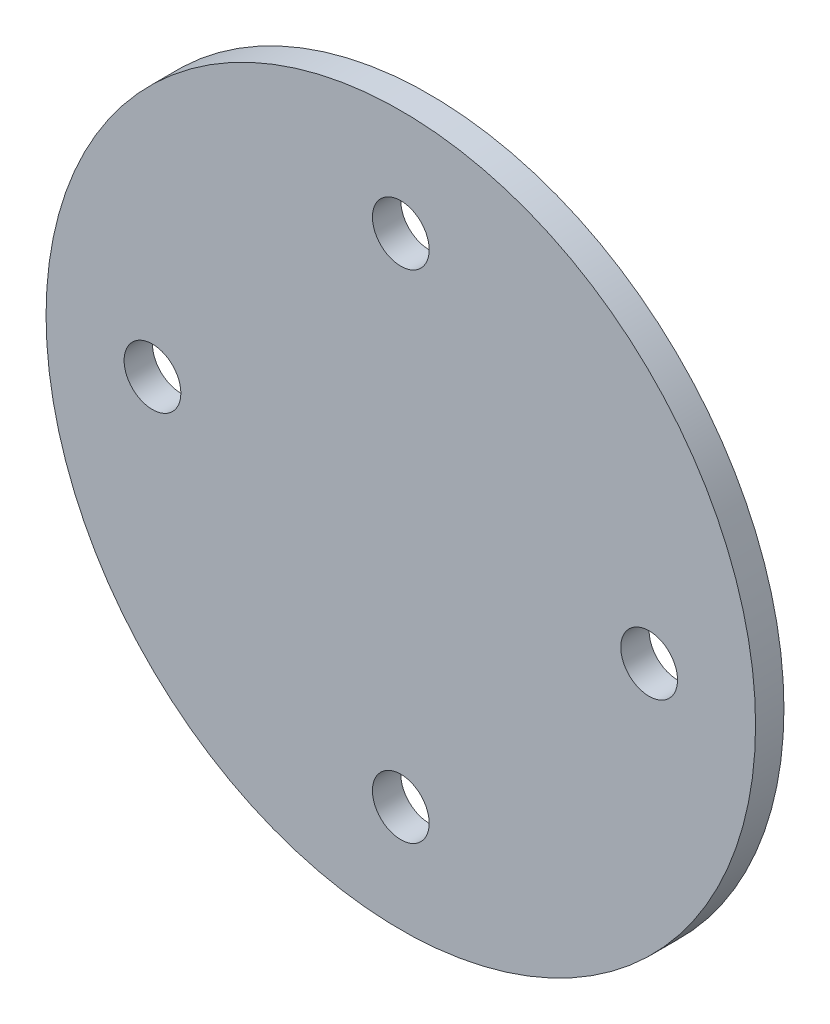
ISO-10303-21;
HEADER;
FILE_DESCRIPTION(('STEP AP214'),'2;1');
FILE_NAME('part.step','',(''),(''),'','','');
FILE_SCHEMA(('AUTOMOTIVE_DESIGN { 1 0 10303 214 1 1 1 1 }'));
ENDSEC;
DATA;
#1=APPLICATION_CONTEXT('core data for automotive mechanical design processes');
#2=APPLICATION_PROTOCOL_DEFINITION('international standard','automotive_design',2000,#1);
#3=PRODUCT_CONTEXT('',#1,'mechanical');
#4=PRODUCT('Part','Part','',(#3));
#5=PRODUCT_RELATED_PRODUCT_CATEGORY('part','',(#4));
#6=PRODUCT_DEFINITION_FORMATION('','',#4);
#7=PRODUCT_DEFINITION_CONTEXT('part definition',#1,'design');
#8=PRODUCT_DEFINITION('design','',#6,#7);
#9=PRODUCT_DEFINITION_SHAPE('','',#8);
#10=(LENGTH_UNIT() NAMED_UNIT(*) SI_UNIT(.MILLI.,.METRE.));
#11=(NAMED_UNIT(*) PLANE_ANGLE_UNIT() SI_UNIT($,.RADIAN.));
#12=(NAMED_UNIT(*) SI_UNIT($,.STERADIAN.) SOLID_ANGLE_UNIT());
#13=UNCERTAINTY_MEASURE_WITH_UNIT(LENGTH_MEASURE(1.E-05),#10,'distance_accuracy_value','');
#14=(GEOMETRIC_REPRESENTATION_CONTEXT(3) GLOBAL_UNCERTAINTY_ASSIGNED_CONTEXT((#13)) GLOBAL_UNIT_ASSIGNED_CONTEXT((#10,
#11,#12)) REPRESENTATION_CONTEXT('',''));
#15=CARTESIAN_POINT('',(0.,0.,0.));
#16=DIRECTION('',(0.,0.,1.));
#17=DIRECTION('',(1.,0.,0.));
#18=AXIS2_PLACEMENT_3D('',#15,#16,#17);
#19=CARTESIAN_POINT('',(0.,0.,4.));
#20=DIRECTION('',(0.,0.,1.));
#21=DIRECTION('',(1.,0.,0.));
#22=AXIS2_PLACEMENT_3D('',#19,#20,#21);
#23=PLANE('',#22);
#24=CARTESIAN_POINT('',(-2.46330733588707E-13,-35.,4.));
#25=DIRECTION('',(0.,0.,1.));
#26=DIRECTION('',(1.,0.,0.));
#27=AXIS2_PLACEMENT_3D('',#24,#25,#26);
#28=CIRCLE('',#27,4.00000000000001);
#29=CARTESIAN_POINT('',(3.99999999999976,-35.,4.));
#30=VERTEX_POINT('',#29);
#31=EDGE_CURVE('E57',#30,#30,#28,.T.);
#32=ORIENTED_EDGE('',*,*,#31,.F.);
#33=EDGE_LOOP('',(#32));
#34=FACE_BOUND('',#33,.T.);
#35=CARTESIAN_POINT('',(0.,35.,4.));
#36=DIRECTION('',(0.,0.,1.));
#37=DIRECTION('',(1.,0.,0.));
#38=AXIS2_PLACEMENT_3D('',#35,#36,#37);
#39=CIRCLE('',#38,4.);
#40=CARTESIAN_POINT('',(4.,35.,4.));
#41=VERTEX_POINT('',#40);
#42=EDGE_CURVE('E42',#41,#41,#39,.T.);
#43=ORIENTED_EDGE('',*,*,#42,.F.);
#44=EDGE_LOOP('',(#43));
#45=FACE_BOUND('',#44,.T.);
#46=CARTESIAN_POINT('',(0.,0.,4.));
#47=DIRECTION('',(0.,0.,1.));
#48=DIRECTION('',(1.,0.,0.));
#49=AXIS2_PLACEMENT_3D('',#46,#47,#48);
#50=CIRCLE('',#49,50.);
#51=CARTESIAN_POINT('',(50.,0.,4.));
#52=VERTEX_POINT('',#51);
#53=EDGE_CURVE('E10',#52,#52,#50,.T.);
#54=ORIENTED_EDGE('',*,*,#53,.T.);
#55=EDGE_LOOP('',(#54));
#56=FACE_BOUND('',#55,.T.);
#57=CARTESIAN_POINT('',(35.,-1.21430643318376E-13,4.));
#58=DIRECTION('',(0.,0.,1.));
#59=DIRECTION('',(1.,0.,0.));
#60=AXIS2_PLACEMENT_3D('',#57,#58,#59);
#61=CIRCLE('',#60,4.00000000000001);
#62=CARTESIAN_POINT('',(39.,-1.21430643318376E-13,4.));
#63=VERTEX_POINT('',#62);
#64=EDGE_CURVE('E51',#63,#63,#61,.T.);
#65=ORIENTED_EDGE('',*,*,#64,.F.);
#66=EDGE_LOOP('',(#65));
#67=FACE_BOUND('',#66,.T.);
#68=CARTESIAN_POINT('',(-35.,3.7470027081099E-13,4.));
#69=DIRECTION('',(0.,0.,1.));
#70=DIRECTION('',(1.,0.,0.));
#71=AXIS2_PLACEMENT_3D('',#68,#69,#70);
#72=CIRCLE('',#71,4.);
#73=CARTESIAN_POINT('',(-31.,3.7470027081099E-13,4.));
#74=VERTEX_POINT('',#73);
#75=EDGE_CURVE('E63',#74,#74,#72,.T.);
#76=ORIENTED_EDGE('',*,*,#75,.F.);
#77=EDGE_LOOP('',(#76));
#78=FACE_BOUND('',#77,.T.);
#79=ADVANCED_FACE('F31',(#34,#45,#56,#67,#78),#23,.T.);
#80=CARTESIAN_POINT('',(0.,0.,0.));
#81=DIRECTION('',(0.,0.,1.));
#82=DIRECTION('',(1.,0.,0.));
#83=AXIS2_PLACEMENT_3D('',#80,#81,#82);
#84=PLANE('',#83);
#85=CARTESIAN_POINT('',(-2.46330733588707E-13,-35.,0.));
#86=DIRECTION('',(0.,0.,1.));
#87=DIRECTION('',(1.,0.,0.));
#88=AXIS2_PLACEMENT_3D('',#85,#86,#87);
#89=CIRCLE('',#88,4.00000000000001);
#90=CARTESIAN_POINT('',(3.99999999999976,-35.,0.));
#91=VERTEX_POINT('',#90);
#92=EDGE_CURVE('E60',#91,#91,#89,.T.);
#93=ORIENTED_EDGE('',*,*,#92,.T.);
#94=EDGE_LOOP('',(#93));
#95=FACE_BOUND('',#94,.T.);
#96=CARTESIAN_POINT('',(0.,35.,0.));
#97=DIRECTION('',(0.,0.,1.));
#98=DIRECTION('',(1.,0.,0.));
#99=AXIS2_PLACEMENT_3D('',#96,#97,#98);
#100=CIRCLE('',#99,4.);
#101=CARTESIAN_POINT('',(4.,35.,0.));
#102=VERTEX_POINT('',#101);
#103=EDGE_CURVE('E46',#102,#102,#100,.T.);
#104=ORIENTED_EDGE('',*,*,#103,.T.);
#105=EDGE_LOOP('',(#104));
#106=FACE_BOUND('',#105,.T.);
#107=CARTESIAN_POINT('',(0.,0.,0.));
#108=DIRECTION('',(0.,0.,1.));
#109=DIRECTION('',(1.,0.,0.));
#110=AXIS2_PLACEMENT_3D('',#107,#108,#109);
#111=CIRCLE('',#110,50.);
#112=CARTESIAN_POINT('',(50.,0.,0.));
#113=VERTEX_POINT('',#112);
#114=EDGE_CURVE('E38',#113,#113,#111,.T.);
#115=ORIENTED_EDGE('',*,*,#114,.F.);
#116=EDGE_LOOP('',(#115));
#117=FACE_BOUND('',#116,.T.);
#118=CARTESIAN_POINT('',(35.,-1.21430643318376E-13,0.));
#119=DIRECTION('',(0.,0.,1.));
#120=DIRECTION('',(1.,0.,0.));
#121=AXIS2_PLACEMENT_3D('',#118,#119,#120);
#122=CIRCLE('',#121,4.00000000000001);
#123=CARTESIAN_POINT('',(39.,-1.21430643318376E-13,0.));
#124=VERTEX_POINT('',#123);
#125=EDGE_CURVE('E54',#124,#124,#122,.T.);
#126=ORIENTED_EDGE('',*,*,#125,.T.);
#127=EDGE_LOOP('',(#126));
#128=FACE_BOUND('',#127,.T.);
#129=CARTESIAN_POINT('',(-35.,3.7470027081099E-13,0.));
#130=DIRECTION('',(0.,0.,1.));
#131=DIRECTION('',(1.,0.,0.));
#132=AXIS2_PLACEMENT_3D('',#129,#130,#131);
#133=CIRCLE('',#132,4.);
#134=CARTESIAN_POINT('',(-31.,3.7470027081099E-13,0.));
#135=VERTEX_POINT('',#134);
#136=EDGE_CURVE('E66',#135,#135,#133,.T.);
#137=ORIENTED_EDGE('',*,*,#136,.T.);
#138=EDGE_LOOP('',(#137));
#139=FACE_BOUND('',#138,.T.);
#140=ADVANCED_FACE('F70',(#95,#106,#117,#128,#139),#84,.F.);
#141=CARTESIAN_POINT('',(0.,0.,4.));
#142=DIRECTION('',(0.,0.,-1.));
#143=DIRECTION('',(-1.,0.,0.));
#144=AXIS2_PLACEMENT_3D('',#141,#142,#143);
#145=CYLINDRICAL_SURFACE('',#144,50.);
#146=ORIENTED_EDGE('',*,*,#53,.F.);
#147=EDGE_LOOP('',(#146));
#148=FACE_BOUND('',#147,.T.);
#149=ORIENTED_EDGE('',*,*,#114,.T.);
#150=EDGE_LOOP('',(#149));
#151=FACE_BOUND('',#150,.T.);
#152=ADVANCED_FACE('F33',(#148,#151),#145,.T.);
#153=CARTESIAN_POINT('',(0.,35.,4.));
#154=DIRECTION('',(0.,0.,-1.));
#155=DIRECTION('',(-1.,0.,0.));
#156=AXIS2_PLACEMENT_3D('',#153,#154,#155);
#157=CYLINDRICAL_SURFACE('',#156,4.);
#158=ORIENTED_EDGE('',*,*,#42,.T.);
#159=EDGE_LOOP('',(#158));
#160=FACE_BOUND('',#159,.T.);
#161=ORIENTED_EDGE('',*,*,#103,.F.);
#162=EDGE_LOOP('',(#161));
#163=FACE_BOUND('',#162,.T.);
#164=ADVANCED_FACE('F93',(#160,#163),#157,.F.);
#165=CARTESIAN_POINT('',(35.,-1.21430643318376E-13,4.));
#166=DIRECTION('',(0.,0.,-1.));
#167=DIRECTION('',(-1.,0.,0.));
#168=AXIS2_PLACEMENT_3D('',#165,#166,#167);
#169=CYLINDRICAL_SURFACE('',#168,4.00000000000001);
#170=ORIENTED_EDGE('',*,*,#64,.T.);
#171=EDGE_LOOP('',(#170));
#172=FACE_BOUND('',#171,.T.);
#173=ORIENTED_EDGE('',*,*,#125,.F.);
#174=EDGE_LOOP('',(#173));
#175=FACE_BOUND('',#174,.T.);
#176=ADVANCED_FACE('F80',(#172,#175),#169,.F.);
#177=CARTESIAN_POINT('',(-2.46330733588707E-13,-35.,4.));
#178=DIRECTION('',(0.,0.,-1.));
#179=DIRECTION('',(-1.,0.,0.));
#180=AXIS2_PLACEMENT_3D('',#177,#178,#179);
#181=CYLINDRICAL_SURFACE('',#180,4.00000000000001);
#182=ORIENTED_EDGE('',*,*,#31,.T.);
#183=EDGE_LOOP('',(#182));
#184=FACE_BOUND('',#183,.T.);
#185=ORIENTED_EDGE('',*,*,#92,.F.);
#186=EDGE_LOOP('',(#185));
#187=FACE_BOUND('',#186,.T.);
#188=ADVANCED_FACE('F74',(#184,#187),#181,.F.);
#189=CARTESIAN_POINT('',(-35.,3.7470027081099E-13,4.));
#190=DIRECTION('',(0.,0.,-1.));
#191=DIRECTION('',(-1.,0.,0.));
#192=AXIS2_PLACEMENT_3D('',#189,#190,#191);
#193=CYLINDRICAL_SURFACE('',#192,4.);
#194=ORIENTED_EDGE('',*,*,#75,.T.);
#195=EDGE_LOOP('',(#194));
#196=FACE_BOUND('',#195,.T.);
#197=ORIENTED_EDGE('',*,*,#136,.F.);
#198=EDGE_LOOP('',(#197));
#199=FACE_BOUND('',#198,.T.);
#200=ADVANCED_FACE('F72',(#196,#199),#193,.F.);
#201=CLOSED_SHELL('',(#79,#140,#152,#164,#176,#188,#200));
#202=MANIFOLD_SOLID_BREP('B2',#201);
#203=ADVANCED_BREP_SHAPE_REPRESENTATION('',(#18,#202),#14);
#204=SHAPE_DEFINITION_REPRESENTATION(#9,#203);
ENDSEC;
END-ISO-10303-21;
